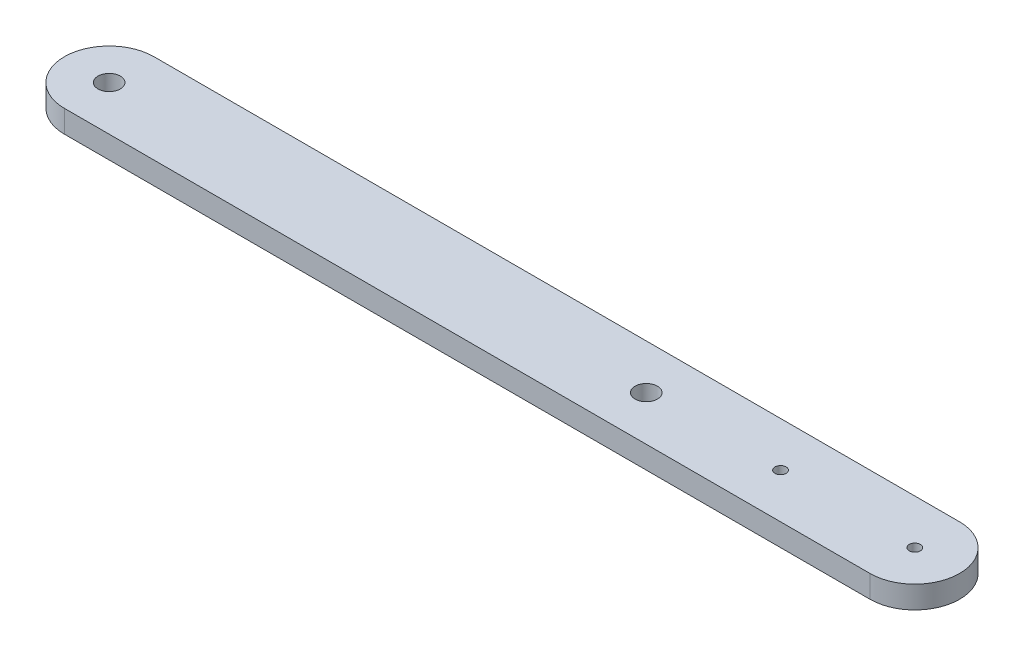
from build123d import *

# Parameters (mm, degrees)
SKETCH1_R           = 12.7
SKETCH1_R_2         = 3.175
SKETCH1_R_3         = 1.5875
BOSS_EXTRUDE1_DEPTH = 6.35
SKETCH2_R           = 3.175
SKETCH2_R_2         = 1.5875
CUT_EXTRUDE1_DEPTH  = 6.35


with BuildPart() as part:
    # Sketch1 → Boss-Extrude1 (new body)
    # profile 1 of 3: a face of its own
    with BuildSketch(Plane(origin=(0, 0, 0), x_dir=(1, 0, 0), z_dir=(0, 1, 0))):
        Circle(SKETCH1_R)
        with Locations(Location((0, 0, 0), (0, 0, 270))):
            Circle(SKETCH1_R_2, mode=Mode.SUBTRACT)
    # profile 2 of 3: a face of its own
    with BuildSketch(Plane(origin=(0, 0, 0), x_dir=(1, 0, 0), z_dir=(0, 1, 0))):
        with BuildLine():
            Line((228.6, 12.7), (0, 12.7))
            ThreePointArc((0, 12.7), (8.980256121, 8.980256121), (12.7, 0))
            ThreePointArc((12.7, 0), (8.980256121, -8.980256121), (0, -12.7))
            Line((0, -12.7), (228.6, -12.7))
            ThreePointArc((228.6, -12.7), (215.9, 0), (228.6, 12.7))
        make_face()
    # profile 3 of 3: a face of its own
    with BuildSketch(Plane(origin=(0, 0, 0), x_dir=(1, 0, 0), z_dir=(0, 1, 0))):
        with Locations((228.6, 0)):
            Circle(SKETCH1_R)
        with Locations(Location((228.6, 0, 0), (0, 0, 270))):
            Circle(SKETCH1_R_3, mode=Mode.SUBTRACT)
    extrude(amount=BOSS_EXTRUDE1_DEPTH)

    # Sketch2 → Cut-Extrude1 (cut)
    with BuildSketch(Plane(origin=(0, 6.35, 0), x_dir=(1, 0, 0), z_dir=(0, 1, 0))):
        with Locations(Location((152.4, 0, 0), (0, 0, 270))):
            Circle(SKETCH2_R)
        with Locations(Location((190.5, 0, 0), (0, 0, 270))):
            Circle(SKETCH2_R_2)
    extrude(amount=-CUT_EXTRUDE1_DEPTH, mode=Mode.SUBTRACT)


solid = part.part
